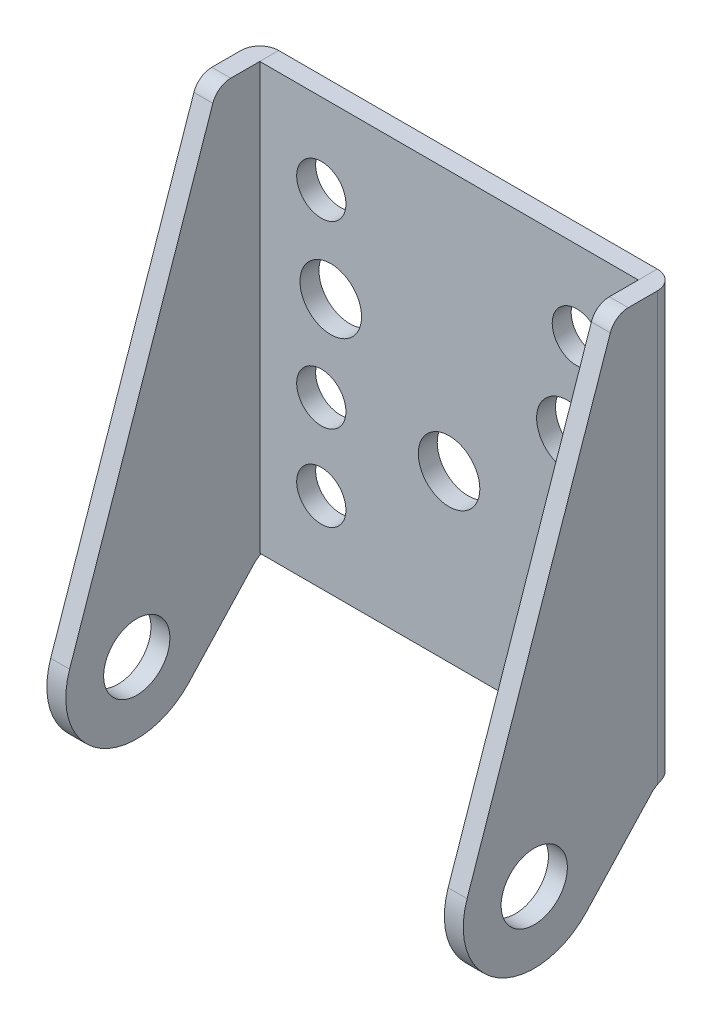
ISO-10303-21;
HEADER;
FILE_DESCRIPTION(('STEP AP214'),'2;1');
FILE_NAME('part.step','',(''),(''),'','','');
FILE_SCHEMA(('AUTOMOTIVE_DESIGN { 1 0 10303 214 1 1 1 1 }'));
ENDSEC;
DATA;
#1=APPLICATION_CONTEXT('core data for automotive mechanical design processes');
#2=APPLICATION_PROTOCOL_DEFINITION('international standard','automotive_design',2000,#1);
#3=PRODUCT_CONTEXT('',#1,'mechanical');
#4=PRODUCT('Part','Part','',(#3));
#5=PRODUCT_RELATED_PRODUCT_CATEGORY('part','',(#4));
#6=PRODUCT_DEFINITION_FORMATION('','',#4);
#7=PRODUCT_DEFINITION_CONTEXT('part definition',#1,'design');
#8=PRODUCT_DEFINITION('design','',#6,#7);
#9=PRODUCT_DEFINITION_SHAPE('','',#8);
#10=(LENGTH_UNIT() NAMED_UNIT(*) SI_UNIT(.MILLI.,.METRE.));
#11=(NAMED_UNIT(*) PLANE_ANGLE_UNIT() SI_UNIT($,.RADIAN.));
#12=(NAMED_UNIT(*) SI_UNIT($,.STERADIAN.) SOLID_ANGLE_UNIT());
#13=UNCERTAINTY_MEASURE_WITH_UNIT(LENGTH_MEASURE(1.E-05),#10,'distance_accuracy_value','');
#14=(GEOMETRIC_REPRESENTATION_CONTEXT(3) GLOBAL_UNCERTAINTY_ASSIGNED_CONTEXT((#13)) GLOBAL_UNIT_ASSIGNED_CONTEXT((#10,
#11,#12)) REPRESENTATION_CONTEXT('',''));
#15=CARTESIAN_POINT('',(0.,0.,0.));
#16=DIRECTION('',(0.,0.,1.));
#17=DIRECTION('',(1.,0.,0.));
#18=AXIS2_PLACEMENT_3D('',#15,#16,#17);
#19=CARTESIAN_POINT('',(-22.,-25.5,15.));
#20=DIRECTION('',(-1.,0.,0.));
#21=DIRECTION('',(0.,1.,0.));
#22=AXIS2_PLACEMENT_3D('',#19,#20,#21);
#23=PLANE('',#22);
#24=DIRECTION('',(0.,0.,1.));
#25=VECTOR('',#24,1.);
#26=CARTESIAN_POINT('',(-22.,22.5,0.));
#27=LINE('',#26,#25);
#28=CARTESIAN_POINT('',(-22.,22.5,2.));
#29=VERTEX_POINT('',#28);
#30=CARTESIAN_POINT('',(-22.,22.5,5.07058096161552));
#31=VERTEX_POINT('',#30);
#32=EDGE_CURVE('E129',#29,#31,#27,.T.);
#33=ORIENTED_EDGE('',*,*,#32,.F.);
#34=DIRECTION('',(0.,1.,0.));
#35=VECTOR('',#34,1.);
#36=CARTESIAN_POINT('',(-22.,-22.5,2.));
#37=LINE('',#36,#35);
#38=CARTESIAN_POINT('',(-22.,-22.7009607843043,2.));
#39=VERTEX_POINT('',#38);
#40=EDGE_CURVE('E66',#29,#39,#37,.F.);
#41=ORIENTED_EDGE('',*,*,#40,.T.);
#42=CARTESIAN_POINT('',(-22.,-24.5,1.12623922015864));
#43=DIRECTION('',(1.,0.,0.));
#44=DIRECTION('',(0.,1.,0.));
#45=AXIS2_PLACEMENT_3D('',#42,#43,#44);
#46=CIRCLE('',#45,2.);
#47=CARTESIAN_POINT('',(-22.,-23.1410955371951,2.59367871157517));
#48=VERTEX_POINT('',#47);
#49=EDGE_CURVE('E170',#48,#39,#46,.F.);
#50=ORIENTED_EDGE('',*,*,#49,.F.);
#51=DIRECTION('',(0.,0.733719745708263,-0.679452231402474));
#52=VECTOR('',#51,1.);
#53=CARTESIAN_POINT('',(-22.,-22.5,2.));
#54=LINE('',#53,#52);
#55=CARTESIAN_POINT('',(-22.,-30.5958917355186,9.49710190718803));
#56=VERTEX_POINT('',#55);
#57=EDGE_CURVE('E133',#56,#48,#54,.T.);
#58=ORIENTED_EDGE('',*,*,#57,.F.);
#59=CARTESIAN_POINT('',(-22.,-25.5,15.));
#60=DIRECTION('',(1.,0.,0.));
#61=DIRECTION('',(0.,1.,0.));
#62=AXIS2_PLACEMENT_3D('',#59,#60,#61);
#63=CIRCLE('',#62,7.5);
#64=CARTESIAN_POINT('',(-22.,-23.0715490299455,22.0959584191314));
#65=VERTEX_POINT('',#64);
#66=EDGE_CURVE('E113',#65,#56,#63,.T.);
#67=ORIENTED_EDGE('',*,*,#66,.F.);
#68=DIRECTION('',(0.,-0.946127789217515,0.323793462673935));
#69=VECTOR('',#68,1.);
#70=CARTESIAN_POINT('',(-22.,22.5,6.5));
#71=LINE('',#70,#69);
#72=CARTESIAN_POINT('',(-22.,21.1475869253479,6.96283654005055));
#73=VERTEX_POINT('',#72);
#74=EDGE_CURVE('E124',#73,#65,#71,.T.);
#75=ORIENTED_EDGE('',*,*,#74,.F.);
#76=CARTESIAN_POINT('',(-22.,20.5,5.07058096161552));
#77=DIRECTION('',(1.,0.,0.));
#78=DIRECTION('',(0.,1.,0.));
#79=AXIS2_PLACEMENT_3D('',#76,#77,#78);
#80=CIRCLE('',#79,2.);
#81=EDGE_CURVE('E165',#31,#73,#80,.T.);
#82=ORIENTED_EDGE('',*,*,#81,.F.);
#83=EDGE_LOOP('',(#33,#41,#50,#58,#67,#75,#82));
#84=FACE_BOUND('',#83,.T.);
#85=CARTESIAN_POINT('',(-22.,-25.5,15.));
#86=DIRECTION('',(1.,0.,0.));
#87=DIRECTION('',(0.,1.,0.));
#88=AXIS2_PLACEMENT_3D('',#85,#86,#87);
#89=CIRCLE('',#88,3.5);
#90=CARTESIAN_POINT('',(-22.,-22.,15.));
#91=VERTEX_POINT('',#90);
#92=EDGE_CURVE('E142',#91,#91,#89,.T.);
#93=ORIENTED_EDGE('',*,*,#92,.T.);
#94=EDGE_LOOP('',(#93));
#95=FACE_BOUND('',#94,.T.);
#96=ADVANCED_FACE('F43',(#84,#95),#23,.T.);
#97=CARTESIAN_POINT('',(-20.,-25.5,15.));
#98=DIRECTION('',(-1.,0.,0.));
#99=DIRECTION('',(0.,1.,0.));
#100=AXIS2_PLACEMENT_3D('',#97,#98,#99);
#101=PLANE('',#100);
#102=DIRECTION('',(0.,-0.946127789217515,0.323793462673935));
#103=VECTOR('',#102,1.);
#104=CARTESIAN_POINT('',(-20.,22.5,6.5));
#105=LINE('',#104,#103);
#106=CARTESIAN_POINT('',(-20.,21.1475869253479,6.96283654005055));
#107=VERTEX_POINT('',#106);
#108=CARTESIAN_POINT('',(-20.,-23.0715490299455,22.0959584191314));
#109=VERTEX_POINT('',#108);
#110=EDGE_CURVE('E145',#107,#109,#105,.T.);
#111=ORIENTED_EDGE('',*,*,#110,.T.);
#112=CARTESIAN_POINT('',(-20.,-25.5,15.));
#113=DIRECTION('',(1.,0.,0.));
#114=DIRECTION('',(0.,1.,0.));
#115=AXIS2_PLACEMENT_3D('',#112,#113,#114);
#116=CIRCLE('',#115,7.5);
#117=CARTESIAN_POINT('',(-20.,-30.5958917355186,9.49710190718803));
#118=VERTEX_POINT('',#117);
#119=EDGE_CURVE('E116',#109,#118,#116,.T.);
#120=ORIENTED_EDGE('',*,*,#119,.T.);
#121=DIRECTION('',(0.,0.733719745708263,-0.679452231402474));
#122=VECTOR('',#121,1.);
#123=CARTESIAN_POINT('',(-20.,-22.5,2.));
#124=LINE('',#123,#122);
#125=CARTESIAN_POINT('',(-20.,-23.1410955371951,2.59367871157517));
#126=VERTEX_POINT('',#125);
#127=EDGE_CURVE('E148',#118,#126,#124,.T.);
#128=ORIENTED_EDGE('',*,*,#127,.T.);
#129=CARTESIAN_POINT('',(-20.,-24.5,1.12623922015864));
#130=DIRECTION('',(1.,0.,0.));
#131=DIRECTION('',(0.,1.,0.));
#132=AXIS2_PLACEMENT_3D('',#129,#130,#131);
#133=CIRCLE('',#132,2.);
#134=CARTESIAN_POINT('',(-20.,-22.5,1.12623922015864));
#135=VERTEX_POINT('',#134);
#136=EDGE_CURVE('E167',#135,#126,#133,.T.);
#137=ORIENTED_EDGE('',*,*,#136,.F.);
#138=DIRECTION('',(0.,0.,-1.));
#139=VECTOR('',#138,1.);
#140=CARTESIAN_POINT('',(-20.,-22.5,2.));
#141=LINE('',#140,#139);
#142=CARTESIAN_POINT('',(-20.,-22.5,0.));
#143=VERTEX_POINT('',#142);
#144=EDGE_CURVE('E151',#135,#143,#141,.T.);
#145=ORIENTED_EDGE('',*,*,#144,.T.);
#146=DIRECTION('',(0.,1.,0.));
#147=VECTOR('',#146,1.);
#148=CARTESIAN_POINT('',(-20.,-22.5,0.));
#149=LINE('',#148,#147);
#150=CARTESIAN_POINT('',(-20.,22.5,0.));
#151=VERTEX_POINT('',#150);
#152=EDGE_CURVE('E138',#143,#151,#149,.T.);
#153=ORIENTED_EDGE('',*,*,#152,.T.);
#154=DIRECTION('',(0.,0.,1.));
#155=VECTOR('',#154,1.);
#156=CARTESIAN_POINT('',(-20.,22.5,0.));
#157=LINE('',#156,#155);
#158=CARTESIAN_POINT('',(-20.,22.5,5.07058096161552));
#159=VERTEX_POINT('',#158);
#160=EDGE_CURVE('E141',#151,#159,#157,.T.);
#161=ORIENTED_EDGE('',*,*,#160,.T.);
#162=CARTESIAN_POINT('',(-20.,20.5,5.07058096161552));
#163=DIRECTION('',(1.,0.,0.));
#164=DIRECTION('',(0.,1.,0.));
#165=AXIS2_PLACEMENT_3D('',#162,#163,#164);
#166=CIRCLE('',#165,2.);
#167=EDGE_CURVE('E159',#107,#159,#166,.F.);
#168=ORIENTED_EDGE('',*,*,#167,.F.);
#169=EDGE_LOOP('',(#111,#120,#128,#137,#145,#153,#161,#168));
#170=FACE_BOUND('',#169,.T.);
#171=CARTESIAN_POINT('',(-20.,-25.5,15.));
#172=DIRECTION('',(1.,0.,0.));
#173=DIRECTION('',(0.,1.,0.));
#174=AXIS2_PLACEMENT_3D('',#171,#172,#173);
#175=CIRCLE('',#174,3.5);
#176=CARTESIAN_POINT('',(-20.,-22.,15.));
#177=VERTEX_POINT('',#176);
#178=EDGE_CURVE('E227',#177,#177,#175,.T.);
#179=ORIENTED_EDGE('',*,*,#178,.F.);
#180=EDGE_LOOP('',(#179));
#181=FACE_BOUND('',#180,.T.);
#182=ADVANCED_FACE('F193',(#170,#181),#101,.F.);
#183=CARTESIAN_POINT('',(-22.,22.5,0.));
#184=DIRECTION('',(0.,-1.,0.));
#185=DIRECTION('',(0.,0.,-1.));
#186=AXIS2_PLACEMENT_3D('',#183,#184,#185);
#187=PLANE('',#186);
#188=ORIENTED_EDGE('',*,*,#160,.F.);
#189=CARTESIAN_POINT('',(-20.,22.5,2.));
#190=DIRECTION('',(0.,-1.,0.));
#191=DIRECTION('',(0.,0.,-1.));
#192=AXIS2_PLACEMENT_3D('',#189,#190,#191);
#193=CIRCLE('',#192,2.);
#194=EDGE_CURVE('E172',#151,#29,#193,.F.);
#195=ORIENTED_EDGE('',*,*,#194,.T.);
#196=ORIENTED_EDGE('',*,*,#32,.T.);
#197=DIRECTION('',(1.,0.,0.));
#198=VECTOR('',#197,1.);
#199=CARTESIAN_POINT('',(-22.,22.5,5.07058096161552));
#200=LINE('',#199,#198);
#201=EDGE_CURVE('E162',#159,#31,#200,.F.);
#202=ORIENTED_EDGE('',*,*,#201,.F.);
#203=EDGE_LOOP('',(#188,#195,#196,#202));
#204=FACE_BOUND('',#203,.T.);
#205=ADVANCED_FACE('F184',(#204),#187,.F.);
#206=CARTESIAN_POINT('',(-22.,22.5,6.5));
#207=DIRECTION('',(0.,-0.323793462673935,-0.946127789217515));
#208=DIRECTION('',(0.,0.946127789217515,-0.323793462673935));
#209=AXIS2_PLACEMENT_3D('',#206,#207,#208);
#210=PLANE('',#209);
#211=ORIENTED_EDGE('',*,*,#74,.T.);
#212=DIRECTION('',(1.,0.,0.));
#213=VECTOR('',#212,1.);
#214=CARTESIAN_POINT('',(-22.,-23.0715490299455,22.0959584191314));
#215=LINE('',#214,#213);
#216=EDGE_CURVE('E109',#65,#109,#215,.T.);
#217=ORIENTED_EDGE('',*,*,#216,.T.);
#218=ORIENTED_EDGE('',*,*,#110,.F.);
#219=DIRECTION('',(1.,0.,0.));
#220=VECTOR('',#219,1.);
#221=CARTESIAN_POINT('',(-22.,21.1475869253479,6.96283654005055));
#222=LINE('',#221,#220);
#223=EDGE_CURVE('E126',#73,#107,#222,.T.);
#224=ORIENTED_EDGE('',*,*,#223,.F.);
#225=EDGE_LOOP('',(#211,#217,#218,#224));
#226=FACE_BOUND('',#225,.T.);
#227=ADVANCED_FACE('F125',(#226),#210,.F.);
#228=CARTESIAN_POINT('',(-22.,-25.5,15.));
#229=DIRECTION('',(1.,0.,0.));
#230=DIRECTION('',(0.,-1.,0.));
#231=AXIS2_PLACEMENT_3D('',#228,#229,#230);
#232=CYLINDRICAL_SURFACE('',#231,7.5);
#233=ORIENTED_EDGE('',*,*,#119,.F.);
#234=ORIENTED_EDGE('',*,*,#216,.F.);
#235=ORIENTED_EDGE('',*,*,#66,.T.);
#236=DIRECTION('',(1.,0.,0.));
#237=VECTOR('',#236,1.);
#238=CARTESIAN_POINT('',(-22.,-30.5958917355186,9.49710190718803));
#239=LINE('',#238,#237);
#240=EDGE_CURVE('E121',#56,#118,#239,.T.);
#241=ORIENTED_EDGE('',*,*,#240,.T.);
#242=EDGE_LOOP('',(#233,#234,#235,#241));
#243=FACE_BOUND('',#242,.T.);
#244=ADVANCED_FACE('F111',(#243),#232,.T.);
#245=CARTESIAN_POINT('',(-22.,-22.5,2.));
#246=DIRECTION('',(0.,0.679452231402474,0.733719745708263));
#247=DIRECTION('',(0.,-0.733719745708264,0.679452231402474));
#248=AXIS2_PLACEMENT_3D('',#245,#246,#247);
#249=PLANE('',#248);
#250=ORIENTED_EDGE('',*,*,#127,.F.);
#251=ORIENTED_EDGE('',*,*,#240,.F.);
#252=ORIENTED_EDGE('',*,*,#57,.T.);
#253=DIRECTION('',(1.,0.,0.));
#254=VECTOR('',#253,1.);
#255=CARTESIAN_POINT('',(-22.,-23.1410955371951,2.59367871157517));
#256=LINE('',#255,#254);
#257=EDGE_CURVE('E156',#126,#48,#256,.F.);
#258=ORIENTED_EDGE('',*,*,#257,.F.);
#259=EDGE_LOOP('',(#250,#251,#252,#258));
#260=FACE_BOUND('',#259,.T.);
#261=ADVANCED_FACE('F205',(#260),#249,.F.);
#262=CARTESIAN_POINT('',(-22.,-22.5,2.));
#263=DIRECTION('',(0.,1.,0.));
#264=DIRECTION('',(1.,0.,0.));
#265=AXIS2_PLACEMENT_3D('',#262,#263,#264);
#266=PLANE('',#265);
#267=DIRECTION('',(1.,0.,0.));
#268=VECTOR('',#267,1.);
#269=CARTESIAN_POINT('',(-20.,-22.5,1.12623922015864));
#270=LINE('',#269,#268);
#271=CARTESIAN_POINT('',(-21.7990392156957,-22.5,1.12623922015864));
#272=VERTEX_POINT('',#271);
#273=EDGE_CURVE('E120',#272,#135,#270,.T.);
#274=ORIENTED_EDGE('',*,*,#273,.F.);
#275=CARTESIAN_POINT('',(-20.,-22.5,2.));
#276=DIRECTION('',(0.,1.,0.));
#277=DIRECTION('',(-1.,0.,0.));
#278=AXIS2_PLACEMENT_3D('',#275,#276,#277);
#279=CIRCLE('',#278,2.);
#280=EDGE_CURVE('E12',#272,#143,#279,.F.);
#281=ORIENTED_EDGE('',*,*,#280,.T.);
#282=ORIENTED_EDGE('',*,*,#144,.F.);
#283=EDGE_LOOP('',(#274,#281,#282));
#284=FACE_BOUND('',#283,.T.);
#285=ADVANCED_FACE('F202',(#284),#266,.F.);
#286=CARTESIAN_POINT('',(-22.,-25.5,15.));
#287=DIRECTION('',(1.,0.,0.));
#288=DIRECTION('',(0.,-1.,0.));
#289=AXIS2_PLACEMENT_3D('',#286,#287,#288);
#290=CYLINDRICAL_SURFACE('',#289,3.5);
#291=ORIENTED_EDGE('',*,*,#92,.F.);
#292=EDGE_LOOP('',(#291));
#293=FACE_BOUND('',#292,.T.);
#294=ORIENTED_EDGE('',*,*,#178,.T.);
#295=EDGE_LOOP('',(#294));
#296=FACE_BOUND('',#295,.T.);
#297=ADVANCED_FACE('F183',(#293,#296),#290,.F.);
#298=CARTESIAN_POINT('',(-22.,-24.5,1.12623922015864));
#299=DIRECTION('',(-1.,0.,0.));
#300=DIRECTION('',(0.,1.,0.));
#301=AXIS2_PLACEMENT_3D('',#298,#299,#300);
#302=CYLINDRICAL_SURFACE('',#301,2.);
#303=ORIENTED_EDGE('',*,*,#49,.T.);
#304=CARTESIAN_POINT('',(-22.,-22.7009607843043,2.));
#305=CARTESIAN_POINT('',(-22.0000069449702,-22.682475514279,1.96195832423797));
#306=CARTESIAN_POINT('',(-21.9989146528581,-22.665208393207,1.92331665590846));
#307=CARTESIAN_POINT('',(-21.9943773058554,-22.6331897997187,1.84512486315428));
#308=CARTESIAN_POINT('',(-21.9909314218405,-22.6184392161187,1.80557442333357));
#309=CARTESIAN_POINT('',(-21.9816566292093,-22.5919017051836,1.72693731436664));
#310=CARTESIAN_POINT('',(-21.9758931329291,-22.5800467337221,1.68786602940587));
#311=CARTESIAN_POINT('',(-21.961912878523,-22.5588402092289,1.60950760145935));
#312=CARTESIAN_POINT('',(-21.953696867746,-22.5494878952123,1.57022052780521));
#313=CARTESIAN_POINT('',(-21.9278031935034,-22.5273224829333,1.46291954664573));
#314=CARTESIAN_POINT('',(-21.9076044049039,-22.5169971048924,1.39495619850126));
#315=CARTESIAN_POINT('',(-21.8715063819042,-22.5067268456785,1.29374419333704));
#316=CARTESIAN_POINT('',(-21.8583170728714,-22.5041752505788,1.25973549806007));
#317=CARTESIAN_POINT('',(-21.8300677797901,-22.5008118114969,1.19242175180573));
#318=CARTESIAN_POINT('',(-21.8150081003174,-22.4999996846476,1.15911658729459));
#319=CARTESIAN_POINT('',(-21.7990392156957,-22.5,1.12623922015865));
#320=B_SPLINE_CURVE_WITH_KNOTS('',3,(#304,#305,#306,#307,#308,#309,#310,#311,#312,#313,#314,
#315,#316,#317,#318,#319),.UNSPECIFIED.,.F.,.F.,(4,2,2,2,2,2,2,4),(0.,0.126860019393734,
0.25376475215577,0.377314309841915,0.500826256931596,0.714867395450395,0.824485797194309,
0.934086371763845),.UNSPECIFIED.);
#321=EDGE_CURVE('E52',#39,#272,#320,.T.);
#322=ORIENTED_EDGE('',*,*,#321,.T.);
#323=ORIENTED_EDGE('',*,*,#273,.T.);
#324=ORIENTED_EDGE('',*,*,#136,.T.);
#325=ORIENTED_EDGE('',*,*,#257,.T.);
#326=EDGE_LOOP('',(#303,#322,#323,#324,#325));
#327=FACE_BOUND('',#326,.T.);
#328=ADVANCED_FACE('F178',(#327),#302,.F.);
#329=CARTESIAN_POINT('',(-22.,20.5,5.07058096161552));
#330=DIRECTION('',(1.,0.,0.));
#331=DIRECTION('',(0.,-1.,0.));
#332=AXIS2_PLACEMENT_3D('',#329,#330,#331);
#333=CYLINDRICAL_SURFACE('',#332,2.);
#334=ORIENTED_EDGE('',*,*,#81,.T.);
#335=ORIENTED_EDGE('',*,*,#223,.T.);
#336=ORIENTED_EDGE('',*,*,#167,.T.);
#337=ORIENTED_EDGE('',*,*,#201,.T.);
#338=EDGE_LOOP('',(#334,#335,#336,#337));
#339=FACE_BOUND('',#338,.T.);
#340=ADVANCED_FACE('F182',(#339),#333,.T.);
#341=CARTESIAN_POINT('',(-20.,-22.5,2.));
#342=DIRECTION('',(0.,-1.,0.));
#343=DIRECTION('',(1.,0.,0.));
#344=AXIS2_PLACEMENT_3D('',#341,#342,#343);
#345=CYLINDRICAL_SURFACE('',#344,2.);
#346=ORIENTED_EDGE('',*,*,#321,.F.);
#347=ORIENTED_EDGE('',*,*,#40,.F.);
#348=ORIENTED_EDGE('',*,*,#194,.F.);
#349=ORIENTED_EDGE('',*,*,#152,.F.);
#350=ORIENTED_EDGE('',*,*,#280,.F.);
#351=EDGE_LOOP('',(#346,#347,#348,#349,#350));
#352=FACE_BOUND('',#351,.T.);
#353=ADVANCED_FACE('F45',(#352),#345,.T.);
#354=CLOSED_SHELL('',(#96,#182,#205,#227,#244,#261,#285,#297,#328,#340,#353));
#355=MANIFOLD_SOLID_BREP('B2',#354);
#356=CARTESIAN_POINT('',(22.,-25.5,15.));
#357=DIRECTION('',(1.,0.,0.));
#358=DIRECTION('',(0.,1.,0.));
#359=AXIS2_PLACEMENT_3D('',#356,#357,#358);
#360=PLANE('',#359);
#361=CARTESIAN_POINT('',(22.,-24.5,1.12623922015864));
#362=DIRECTION('',(1.,0.,0.));
#363=DIRECTION('',(0.,1.,0.));
#364=AXIS2_PLACEMENT_3D('',#361,#362,#363);
#365=CIRCLE('',#364,2.);
#366=CARTESIAN_POINT('',(22.,-23.1410955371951,2.59367871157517));
#367=VERTEX_POINT('',#366);
#368=CARTESIAN_POINT('',(22.,-22.7009607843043,2.));
#369=VERTEX_POINT('',#368);
#370=EDGE_CURVE('E433',#367,#369,#365,.F.);
#371=ORIENTED_EDGE('',*,*,#370,.T.);
#372=DIRECTION('',(0.,1.,0.));
#373=VECTOR('',#372,1.);
#374=CARTESIAN_POINT('',(22.,22.5,2.));
#375=LINE('',#374,#373);
#376=CARTESIAN_POINT('',(22.,22.5,2.));
#377=VERTEX_POINT('',#376);
#378=EDGE_CURVE('E435',#369,#377,#375,.T.);
#379=ORIENTED_EDGE('',*,*,#378,.T.);
#380=DIRECTION('',(0.,0.,1.));
#381=VECTOR('',#380,1.);
#382=CARTESIAN_POINT('',(22.,22.5,0.));
#383=LINE('',#382,#381);
#384=CARTESIAN_POINT('',(22.,22.5,5.07058096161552));
#385=VERTEX_POINT('',#384);
#386=EDGE_CURVE('E384',#377,#385,#383,.T.);
#387=ORIENTED_EDGE('',*,*,#386,.T.);
#388=CARTESIAN_POINT('',(22.,20.5,5.07058096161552));
#389=DIRECTION('',(1.,0.,0.));
#390=DIRECTION('',(0.,1.,0.));
#391=AXIS2_PLACEMENT_3D('',#388,#389,#390);
#392=CIRCLE('',#391,2.);
#393=CARTESIAN_POINT('',(22.,21.1475869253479,6.96283654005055));
#394=VERTEX_POINT('',#393);
#395=EDGE_CURVE('E380',#385,#394,#392,.T.);
#396=ORIENTED_EDGE('',*,*,#395,.T.);
#397=DIRECTION('',(0.,-0.946127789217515,0.323793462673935));
#398=VECTOR('',#397,1.);
#399=CARTESIAN_POINT('',(22.,22.5,6.5));
#400=LINE('',#399,#398);
#401=CARTESIAN_POINT('',(22.,-23.0715490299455,22.0959584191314));
#402=VERTEX_POINT('',#401);
#403=EDGE_CURVE('E372',#394,#402,#400,.T.);
#404=ORIENTED_EDGE('',*,*,#403,.T.);
#405=CARTESIAN_POINT('',(22.,-25.5,15.));
#406=DIRECTION('',(1.,0.,0.));
#407=DIRECTION('',(0.,1.,0.));
#408=AXIS2_PLACEMENT_3D('',#405,#406,#407);
#409=CIRCLE('',#408,7.5);
#410=CARTESIAN_POINT('',(22.,-30.5958917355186,9.49710190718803));
#411=VERTEX_POINT('',#410);
#412=EDGE_CURVE('E377',#402,#411,#409,.T.);
#413=ORIENTED_EDGE('',*,*,#412,.T.);
#414=DIRECTION('',(0.,0.733719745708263,-0.679452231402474));
#415=VECTOR('',#414,1.);
#416=CARTESIAN_POINT('',(22.,-22.5,2.));
#417=LINE('',#416,#415);
#418=EDGE_CURVE('E399',#411,#367,#417,.T.);
#419=ORIENTED_EDGE('',*,*,#418,.T.);
#420=EDGE_LOOP('',(#371,#379,#387,#396,#404,#413,#419));
#421=FACE_BOUND('',#420,.T.);
#422=CARTESIAN_POINT('',(22.,-25.5,15.));
#423=DIRECTION('',(1.,0.,0.));
#424=DIRECTION('',(0.,1.,0.));
#425=AXIS2_PLACEMENT_3D('',#422,#423,#424);
#426=CIRCLE('',#425,3.5);
#427=CARTESIAN_POINT('',(22.,-22.,15.));
#428=VERTEX_POINT('',#427);
#429=EDGE_CURVE('E408',#428,#428,#426,.T.);
#430=ORIENTED_EDGE('',*,*,#429,.F.);
#431=EDGE_LOOP('',(#430));
#432=FACE_BOUND('',#431,.T.);
#433=ADVANCED_FACE('F305',(#421,#432),#360,.T.);
#434=CARTESIAN_POINT('',(20.,-25.5,15.));
#435=DIRECTION('',(1.,0.,0.));
#436=DIRECTION('',(0.,1.,0.));
#437=AXIS2_PLACEMENT_3D('',#434,#435,#436);
#438=PLANE('',#437);
#439=DIRECTION('',(0.,-0.946127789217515,0.323793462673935));
#440=VECTOR('',#439,1.);
#441=CARTESIAN_POINT('',(20.,22.5,6.5));
#442=LINE('',#441,#440);
#443=CARTESIAN_POINT('',(20.,21.1475869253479,6.96283654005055));
#444=VERTEX_POINT('',#443);
#445=CARTESIAN_POINT('',(20.,-23.0715490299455,22.0959584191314));
#446=VERTEX_POINT('',#445);
#447=EDGE_CURVE('E390',#444,#446,#442,.T.);
#448=ORIENTED_EDGE('',*,*,#447,.F.);
#449=CARTESIAN_POINT('',(20.,20.5,5.07058096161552));
#450=DIRECTION('',(1.,0.,0.));
#451=DIRECTION('',(0.,1.,0.));
#452=AXIS2_PLACEMENT_3D('',#449,#450,#451);
#453=CIRCLE('',#452,2.);
#454=CARTESIAN_POINT('',(20.,22.5,5.07058096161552));
#455=VERTEX_POINT('',#454);
#456=EDGE_CURVE('E425',#444,#455,#453,.F.);
#457=ORIENTED_EDGE('',*,*,#456,.T.);
#458=DIRECTION('',(0.,0.,1.));
#459=VECTOR('',#458,1.);
#460=CARTESIAN_POINT('',(20.,22.5,0.));
#461=LINE('',#460,#459);
#462=CARTESIAN_POINT('',(20.,22.5,0.));
#463=VERTEX_POINT('',#462);
#464=EDGE_CURVE('E407',#463,#455,#461,.T.);
#465=ORIENTED_EDGE('',*,*,#464,.F.);
#466=DIRECTION('',(0.,1.,0.));
#467=VECTOR('',#466,1.);
#468=CARTESIAN_POINT('',(20.,-22.5,0.));
#469=LINE('',#468,#467);
#470=CARTESIAN_POINT('',(20.,-22.5,0.));
#471=VERTEX_POINT('',#470);
#472=EDGE_CURVE('E404',#471,#463,#469,.T.);
#473=ORIENTED_EDGE('',*,*,#472,.F.);
#474=DIRECTION('',(0.,0.,-1.));
#475=VECTOR('',#474,1.);
#476=CARTESIAN_POINT('',(20.,-22.5,2.));
#477=LINE('',#476,#475);
#478=CARTESIAN_POINT('',(20.,-22.5,1.12623922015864));
#479=VERTEX_POINT('',#478);
#480=EDGE_CURVE('E417',#479,#471,#477,.T.);
#481=ORIENTED_EDGE('',*,*,#480,.F.);
#482=CARTESIAN_POINT('',(20.,-24.5,1.12623922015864));
#483=DIRECTION('',(1.,0.,0.));
#484=DIRECTION('',(0.,1.,0.));
#485=AXIS2_PLACEMENT_3D('',#482,#483,#484);
#486=CIRCLE('',#485,2.);
#487=CARTESIAN_POINT('',(20.,-23.1410955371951,2.59367871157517));
#488=VERTEX_POINT('',#487);
#489=EDGE_CURVE('E431',#479,#488,#486,.T.);
#490=ORIENTED_EDGE('',*,*,#489,.T.);
#491=DIRECTION('',(0.,0.733719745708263,-0.679452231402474));
#492=VECTOR('',#491,1.);
#493=CARTESIAN_POINT('',(20.,-22.5,2.));
#494=LINE('',#493,#492);
#495=CARTESIAN_POINT('',(20.,-30.5958917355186,9.49710190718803));
#496=VERTEX_POINT('',#495);
#497=EDGE_CURVE('E414',#496,#488,#494,.T.);
#498=ORIENTED_EDGE('',*,*,#497,.F.);
#499=CARTESIAN_POINT('',(20.,-25.5,15.));
#500=DIRECTION('',(1.,0.,0.));
#501=DIRECTION('',(0.,1.,0.));
#502=AXIS2_PLACEMENT_3D('',#499,#500,#501);
#503=CIRCLE('',#502,7.5);
#504=EDGE_CURVE('E412',#446,#496,#503,.T.);
#505=ORIENTED_EDGE('',*,*,#504,.F.);
#506=EDGE_LOOP('',(#448,#457,#465,#473,#481,#490,#498,#505));
#507=FACE_BOUND('',#506,.T.);
#508=CARTESIAN_POINT('',(20.,-25.5,15.));
#509=DIRECTION('',(1.,0.,0.));
#510=DIRECTION('',(0.,1.,0.));
#511=AXIS2_PLACEMENT_3D('',#508,#509,#510);
#512=CIRCLE('',#511,3.5);
#513=CARTESIAN_POINT('',(20.,-22.,15.));
#514=VERTEX_POINT('',#513);
#515=EDGE_CURVE('E553',#514,#514,#512,.T.);
#516=ORIENTED_EDGE('',*,*,#515,.T.);
#517=EDGE_LOOP('',(#516));
#518=FACE_BOUND('',#517,.T.);
#519=ADVANCED_FACE('F448',(#507,#518),#438,.F.);
#520=CARTESIAN_POINT('',(22.,22.5,0.));
#521=DIRECTION('',(0.,-1.,0.));
#522=DIRECTION('',(0.,0.,-1.));
#523=AXIS2_PLACEMENT_3D('',#520,#521,#522);
#524=PLANE('',#523);
#525=ORIENTED_EDGE('',*,*,#386,.F.);
#526=CARTESIAN_POINT('',(20.,22.5,2.));
#527=DIRECTION('',(0.,-1.,0.));
#528=DIRECTION('',(0.,0.,-1.));
#529=AXIS2_PLACEMENT_3D('',#526,#527,#528);
#530=CIRCLE('',#529,2.);
#531=EDGE_CURVE('E438',#377,#463,#530,.F.);
#532=ORIENTED_EDGE('',*,*,#531,.T.);
#533=ORIENTED_EDGE('',*,*,#464,.T.);
#534=DIRECTION('',(-1.,0.,0.));
#535=VECTOR('',#534,1.);
#536=CARTESIAN_POINT('',(22.,22.5,5.07058096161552));
#537=LINE('',#536,#535);
#538=EDGE_CURVE('E427',#455,#385,#537,.F.);
#539=ORIENTED_EDGE('',*,*,#538,.T.);
#540=EDGE_LOOP('',(#525,#532,#533,#539));
#541=FACE_BOUND('',#540,.T.);
#542=ADVANCED_FACE('F442',(#541),#524,.F.);
#543=CARTESIAN_POINT('',(22.,22.5,6.5));
#544=DIRECTION('',(0.,-0.323793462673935,-0.946127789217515));
#545=DIRECTION('',(0.,0.946127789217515,-0.323793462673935));
#546=AXIS2_PLACEMENT_3D('',#543,#544,#545);
#547=PLANE('',#546);
#548=ORIENTED_EDGE('',*,*,#403,.F.);
#549=DIRECTION('',(-1.,0.,0.));
#550=VECTOR('',#549,1.);
#551=CARTESIAN_POINT('',(22.,21.1475869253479,6.96283654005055));
#552=LINE('',#551,#550);
#553=EDGE_CURVE('E423',#394,#444,#552,.T.);
#554=ORIENTED_EDGE('',*,*,#553,.T.);
#555=ORIENTED_EDGE('',*,*,#447,.T.);
#556=DIRECTION('',(-1.,0.,0.));
#557=VECTOR('',#556,1.);
#558=CARTESIAN_POINT('',(22.,-23.0715490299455,22.0959584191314));
#559=LINE('',#558,#557);
#560=EDGE_CURVE('E387',#402,#446,#559,.T.);
#561=ORIENTED_EDGE('',*,*,#560,.F.);
#562=EDGE_LOOP('',(#548,#554,#555,#561));
#563=FACE_BOUND('',#562,.T.);
#564=ADVANCED_FACE('F388',(#563),#547,.F.);
#565=CARTESIAN_POINT('',(22.,-25.5,15.));
#566=DIRECTION('',(-1.,0.,0.));
#567=DIRECTION('',(0.,-1.,0.));
#568=AXIS2_PLACEMENT_3D('',#565,#566,#567);
#569=CYLINDRICAL_SURFACE('',#568,7.5);
#570=ORIENTED_EDGE('',*,*,#504,.T.);
#571=DIRECTION('',(-1.,0.,0.));
#572=VECTOR('',#571,1.);
#573=CARTESIAN_POINT('',(22.,-30.5958917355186,9.49710190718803));
#574=LINE('',#573,#572);
#575=EDGE_CURVE('E394',#411,#496,#574,.T.);
#576=ORIENTED_EDGE('',*,*,#575,.F.);
#577=ORIENTED_EDGE('',*,*,#412,.F.);
#578=ORIENTED_EDGE('',*,*,#560,.T.);
#579=EDGE_LOOP('',(#570,#576,#577,#578));
#580=FACE_BOUND('',#579,.T.);
#581=ADVANCED_FACE('F396',(#580),#569,.T.);
#582=CARTESIAN_POINT('',(22.,-22.5,2.));
#583=DIRECTION('',(0.,0.679452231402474,0.733719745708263));
#584=DIRECTION('',(0.,-0.733719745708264,0.679452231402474));
#585=AXIS2_PLACEMENT_3D('',#582,#583,#584);
#586=PLANE('',#585);
#587=ORIENTED_EDGE('',*,*,#497,.T.);
#588=DIRECTION('',(-1.,0.,0.));
#589=VECTOR('',#588,1.);
#590=CARTESIAN_POINT('',(22.,-23.1410955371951,2.59367871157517));
#591=LINE('',#590,#589);
#592=EDGE_CURVE('E421',#488,#367,#591,.F.);
#593=ORIENTED_EDGE('',*,*,#592,.T.);
#594=ORIENTED_EDGE('',*,*,#418,.F.);
#595=ORIENTED_EDGE('',*,*,#575,.T.);
#596=EDGE_LOOP('',(#587,#593,#594,#595));
#597=FACE_BOUND('',#596,.T.);
#598=ADVANCED_FACE('F455',(#597),#586,.F.);
#599=CARTESIAN_POINT('',(22.,-22.5,2.));
#600=DIRECTION('',(0.,1.,0.));
#601=DIRECTION('',(-1.,0.,0.));
#602=AXIS2_PLACEMENT_3D('',#599,#600,#601);
#603=PLANE('',#602);
#604=ORIENTED_EDGE('',*,*,#480,.T.);
#605=CARTESIAN_POINT('',(20.,-22.5,2.));
#606=DIRECTION('',(0.,1.,0.));
#607=DIRECTION('',(-1.,0.,0.));
#608=AXIS2_PLACEMENT_3D('',#605,#606,#607);
#609=CIRCLE('',#608,2.);
#610=CARTESIAN_POINT('',(21.7990392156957,-22.5,1.12623922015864));
#611=VERTEX_POINT('',#610);
#612=EDGE_CURVE('E318',#471,#611,#609,.F.);
#613=ORIENTED_EDGE('',*,*,#612,.T.);
#614=DIRECTION('',(-1.,0.,0.));
#615=VECTOR('',#614,1.);
#616=CARTESIAN_POINT('',(20.,-22.5,1.12623922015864));
#617=LINE('',#616,#615);
#618=EDGE_CURVE('E393',#611,#479,#617,.T.);
#619=ORIENTED_EDGE('',*,*,#618,.T.);
#620=EDGE_LOOP('',(#604,#613,#619));
#621=FACE_BOUND('',#620,.T.);
#622=ADVANCED_FACE('F457',(#621),#603,.F.);
#623=CARTESIAN_POINT('',(22.,-25.5,15.));
#624=DIRECTION('',(-1.,0.,0.));
#625=DIRECTION('',(0.,-1.,0.));
#626=AXIS2_PLACEMENT_3D('',#623,#624,#625);
#627=CYLINDRICAL_SURFACE('',#626,3.5);
#628=ORIENTED_EDGE('',*,*,#429,.T.);
#629=EDGE_LOOP('',(#628));
#630=FACE_BOUND('',#629,.T.);
#631=ORIENTED_EDGE('',*,*,#515,.F.);
#632=EDGE_LOOP('',(#631));
#633=FACE_BOUND('',#632,.T.);
#634=ADVANCED_FACE('F459',(#630,#633),#627,.F.);
#635=CARTESIAN_POINT('',(22.,-24.5,1.12623922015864));
#636=DIRECTION('',(1.,0.,0.));
#637=DIRECTION('',(0.,1.,0.));
#638=AXIS2_PLACEMENT_3D('',#635,#636,#637);
#639=CYLINDRICAL_SURFACE('',#638,2.);
#640=ORIENTED_EDGE('',*,*,#618,.F.);
#641=CARTESIAN_POINT('',(21.7990392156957,-22.5,1.12623922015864));
#642=CARTESIAN_POINT('',(21.817524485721,-22.4999930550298,1.16428089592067));
#643=CARTESIAN_POINT('',(21.834791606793,-22.5010853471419,1.20292256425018));
#644=CARTESIAN_POINT('',(21.8668102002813,-22.5056226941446,1.28111435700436));
#645=CARTESIAN_POINT('',(21.8815607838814,-22.5090685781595,1.32066479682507));
#646=CARTESIAN_POINT('',(21.9080982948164,-22.5183433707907,1.399301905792));
#647=CARTESIAN_POINT('',(21.9199532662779,-22.5241068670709,1.43837319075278));
#648=CARTESIAN_POINT('',(21.9411597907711,-22.538087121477,1.51673161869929));
#649=CARTESIAN_POINT('',(21.9505121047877,-22.546303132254,1.55601869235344));
#650=CARTESIAN_POINT('',(21.9726775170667,-22.5721968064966,1.66331967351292));
#651=CARTESIAN_POINT('',(21.9830028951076,-22.5923955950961,1.73128302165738));
#652=CARTESIAN_POINT('',(21.9932731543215,-22.6284936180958,1.8324950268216));
#653=CARTESIAN_POINT('',(21.9958247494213,-22.6416829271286,1.86650372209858));
#654=CARTESIAN_POINT('',(21.9991881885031,-22.6699322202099,1.93381746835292));
#655=CARTESIAN_POINT('',(22.0000003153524,-22.6849918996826,1.96712263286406));
#656=CARTESIAN_POINT('',(22.,-22.7009607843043,2.));
#657=B_SPLINE_CURVE_WITH_KNOTS('',3,(#641,#642,#643,#644,#645,#646,#647,#648,#649,#650,#651,
#652,#653,#654,#655,#656),.UNSPECIFIED.,.F.,.F.,(4,2,2,2,2,2,2,4),(0.,0.126860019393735,
0.25376475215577,0.377314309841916,0.500826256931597,0.714867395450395,0.824485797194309,
0.934086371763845),.UNSPECIFIED.);
#658=EDGE_CURVE('E41',#611,#369,#657,.T.);
#659=ORIENTED_EDGE('',*,*,#658,.T.);
#660=ORIENTED_EDGE('',*,*,#370,.F.);
#661=ORIENTED_EDGE('',*,*,#592,.F.);
#662=ORIENTED_EDGE('',*,*,#489,.F.);
#663=EDGE_LOOP('',(#640,#659,#660,#661,#662));
#664=FACE_BOUND('',#663,.T.);
#665=ADVANCED_FACE('F452',(#664),#639,.F.);
#666=CARTESIAN_POINT('',(22.,20.5,5.07058096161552));
#667=DIRECTION('',(-1.,0.,0.));
#668=DIRECTION('',(0.,-1.,0.));
#669=AXIS2_PLACEMENT_3D('',#666,#667,#668);
#670=CYLINDRICAL_SURFACE('',#669,2.);
#671=ORIENTED_EDGE('',*,*,#395,.F.);
#672=ORIENTED_EDGE('',*,*,#538,.F.);
#673=ORIENTED_EDGE('',*,*,#456,.F.);
#674=ORIENTED_EDGE('',*,*,#553,.F.);
#675=EDGE_LOOP('',(#671,#672,#673,#674));
#676=FACE_BOUND('',#675,.T.);
#677=ADVANCED_FACE('F485',(#676),#670,.T.);
#678=CARTESIAN_POINT('',(20.,-25.5,2.));
#679=DIRECTION('',(0.,-1.,0.));
#680=DIRECTION('',(1.,0.,0.));
#681=AXIS2_PLACEMENT_3D('',#678,#679,#680);
#682=CYLINDRICAL_SURFACE('',#681,2.);
#683=ORIENTED_EDGE('',*,*,#612,.F.);
#684=ORIENTED_EDGE('',*,*,#472,.T.);
#685=ORIENTED_EDGE('',*,*,#531,.F.);
#686=ORIENTED_EDGE('',*,*,#378,.F.);
#687=ORIENTED_EDGE('',*,*,#658,.F.);
#688=EDGE_LOOP('',(#683,#684,#685,#686,#687));
#689=FACE_BOUND('',#688,.T.);
#690=ADVANCED_FACE('F307',(#689),#682,.T.);
#691=CLOSED_SHELL('',(#433,#519,#542,#564,#581,#598,#622,#634,#665,#677,#690));
#692=MANIFOLD_SOLID_BREP('B6',#691);
#693=CARTESIAN_POINT('',(20.,22.5,2.));
#694=DIRECTION('',(-1.,0.,0.));
#695=DIRECTION('',(0.,-1.,0.));
#696=AXIS2_PLACEMENT_3D('',#693,#694,#695);
#697=PLANE('',#696);
#698=DIRECTION('',(0.,1.,0.));
#699=VECTOR('',#698,1.);
#700=CARTESIAN_POINT('',(20.,22.5,0.));
#701=LINE('',#700,#699);
#702=CARTESIAN_POINT('',(20.,-22.5,0.));
#703=VERTEX_POINT('',#702);
#704=CARTESIAN_POINT('',(20.,22.5,0.));
#705=VERTEX_POINT('',#704);
#706=EDGE_CURVE('E621',#703,#705,#701,.T.);
#707=ORIENTED_EDGE('',*,*,#706,.T.);
#708=DIRECTION('',(0.,0.,-1.));
#709=VECTOR('',#708,1.);
#710=CARTESIAN_POINT('',(20.,22.5,2.));
#711=LINE('',#710,#709);
#712=CARTESIAN_POINT('',(20.,22.5,2.));
#713=VERTEX_POINT('',#712);
#714=EDGE_CURVE('E303',#713,#705,#711,.T.);
#715=ORIENTED_EDGE('',*,*,#714,.F.);
#716=DIRECTION('',(0.,1.,0.));
#717=VECTOR('',#716,1.);
#718=CARTESIAN_POINT('',(20.,22.5,2.));
#719=LINE('',#718,#717);
#720=CARTESIAN_POINT('',(20.,-22.5,2.));
#721=VERTEX_POINT('',#720);
#722=EDGE_CURVE('E609',#721,#713,#719,.T.);
#723=ORIENTED_EDGE('',*,*,#722,.F.);
#724=DIRECTION('',(0.,0.,-1.));
#725=VECTOR('',#724,1.);
#726=CARTESIAN_POINT('',(20.,-22.5,2.));
#727=LINE('',#726,#725);
#728=EDGE_CURVE('E617',#721,#703,#727,.T.);
#729=ORIENTED_EDGE('',*,*,#728,.T.);
#730=EDGE_LOOP('',(#707,#715,#723,#729));
#731=FACE_BOUND('',#730,.T.);
#732=ADVANCED_FACE('F558',(#731),#697,.F.);
#733=CARTESIAN_POINT('',(-20.,22.5,2.));
#734=DIRECTION('',(0.,-1.,0.));
#735=DIRECTION('',(0.,0.,-1.));
#736=AXIS2_PLACEMENT_3D('',#733,#734,#735);
#737=PLANE('',#736);
#738=DIRECTION('',(-1.,0.,0.));
#739=VECTOR('',#738,1.);
#740=CARTESIAN_POINT('',(-20.,22.5,0.));
#741=LINE('',#740,#739);
#742=CARTESIAN_POINT('',(-20.,22.5,0.));
#743=VERTEX_POINT('',#742);
#744=EDGE_CURVE('E613',#705,#743,#741,.T.);
#745=ORIENTED_EDGE('',*,*,#744,.T.);
#746=DIRECTION('',(0.,0.,-1.));
#747=VECTOR('',#746,1.);
#748=CARTESIAN_POINT('',(-20.,22.5,2.));
#749=LINE('',#748,#747);
#750=CARTESIAN_POINT('',(-20.,22.5,2.));
#751=VERTEX_POINT('',#750);
#752=EDGE_CURVE('E566',#751,#743,#749,.T.);
#753=ORIENTED_EDGE('',*,*,#752,.F.);
#754=DIRECTION('',(-1.,0.,0.));
#755=VECTOR('',#754,1.);
#756=CARTESIAN_POINT('',(-20.,22.5,2.));
#757=LINE('',#756,#755);
#758=EDGE_CURVE('E604',#713,#751,#757,.T.);
#759=ORIENTED_EDGE('',*,*,#758,.F.);
#760=ORIENTED_EDGE('',*,*,#714,.T.);
#761=EDGE_LOOP('',(#745,#753,#759,#760));
#762=FACE_BOUND('',#761,.T.);
#763=ADVANCED_FACE('F612',(#762),#737,.F.);
#764=CARTESIAN_POINT('',(-20.,22.5,2.));
#765=DIRECTION('',(1.,0.,0.));
#766=DIRECTION('',(0.,1.,0.));
#767=AXIS2_PLACEMENT_3D('',#764,#765,#766);
#768=PLANE('',#767);
#769=DIRECTION('',(0.,-1.,0.));
#770=VECTOR('',#769,1.);
#771=CARTESIAN_POINT('',(-20.,22.5,0.));
#772=LINE('',#771,#770);
#773=CARTESIAN_POINT('',(-20.,-22.5,0.));
#774=VERTEX_POINT('',#773);
#775=EDGE_CURVE('E591',#743,#774,#772,.T.);
#776=ORIENTED_EDGE('',*,*,#775,.T.);
#777=DIRECTION('',(0.,0.,-1.));
#778=VECTOR('',#777,1.);
#779=CARTESIAN_POINT('',(-20.,-22.5,2.));
#780=LINE('',#779,#778);
#781=CARTESIAN_POINT('',(-20.,-22.5,2.));
#782=VERTEX_POINT('',#781);
#783=EDGE_CURVE('E614',#782,#774,#780,.T.);
#784=ORIENTED_EDGE('',*,*,#783,.F.);
#785=DIRECTION('',(0.,-1.,0.));
#786=VECTOR('',#785,1.);
#787=CARTESIAN_POINT('',(-20.,22.5,2.));
#788=LINE('',#787,#786);
#789=EDGE_CURVE('E607',#751,#782,#788,.T.);
#790=ORIENTED_EDGE('',*,*,#789,.F.);
#791=ORIENTED_EDGE('',*,*,#752,.T.);
#792=EDGE_LOOP('',(#776,#784,#790,#791));
#793=FACE_BOUND('',#792,.T.);
#794=ADVANCED_FACE('F615',(#793),#768,.F.);
#795=CARTESIAN_POINT('',(-20.,-22.5,2.));
#796=DIRECTION('',(0.,1.,0.));
#797=DIRECTION('',(0.,0.,1.));
#798=AXIS2_PLACEMENT_3D('',#795,#796,#797);
#799=PLANE('',#798);
#800=DIRECTION('',(1.,0.,0.));
#801=VECTOR('',#800,1.);
#802=CARTESIAN_POINT('',(-20.,-22.5,0.));
#803=LINE('',#802,#801);
#804=EDGE_CURVE('E597',#774,#703,#803,.T.);
#805=ORIENTED_EDGE('',*,*,#804,.T.);
#806=ORIENTED_EDGE('',*,*,#728,.F.);
#807=DIRECTION('',(1.,0.,0.));
#808=VECTOR('',#807,1.);
#809=CARTESIAN_POINT('',(-20.,-22.5,2.));
#810=LINE('',#809,#808);
#811=EDGE_CURVE('E574',#782,#721,#810,.T.);
#812=ORIENTED_EDGE('',*,*,#811,.F.);
#813=ORIENTED_EDGE('',*,*,#783,.T.);
#814=EDGE_LOOP('',(#805,#806,#812,#813));
#815=FACE_BOUND('',#814,.T.);
#816=ADVANCED_FACE('F629',(#815),#799,.F.);
#817=CARTESIAN_POINT('',(0.,0.,2.));
#818=DIRECTION('',(0.,0.,1.));
#819=DIRECTION('',(1.,0.,0.));
#820=AXIS2_PLACEMENT_3D('',#817,#818,#819);
#821=PLANE('',#820);
#822=CARTESIAN_POINT('',(13.5,-5.,2.));
#823=DIRECTION('',(0.,0.,1.));
#824=DIRECTION('',(1.,0.,0.));
#825=AXIS2_PLACEMENT_3D('',#822,#823,#824);
#826=CIRCLE('',#825,2.6);
#827=CARTESIAN_POINT('',(16.1,-5.,2.));
#828=VERTEX_POINT('',#827);
#829=EDGE_CURVE('E640',#828,#828,#826,.T.);
#830=ORIENTED_EDGE('',*,*,#829,.F.);
#831=EDGE_LOOP('',(#830));
#832=FACE_BOUND('',#831,.T.);
#833=CARTESIAN_POINT('',(12.5,4.5,2.));
#834=DIRECTION('',(0.,0.,1.));
#835=DIRECTION('',(1.,0.,0.));
#836=AXIS2_PLACEMENT_3D('',#833,#834,#835);
#837=CIRCLE('',#836,3.25);
#838=CARTESIAN_POINT('',(15.75,4.5,2.));
#839=VERTEX_POINT('',#838);
#840=EDGE_CURVE('E643',#839,#839,#837,.T.);
#841=ORIENTED_EDGE('',*,*,#840,.F.);
#842=EDGE_LOOP('',(#841));
#843=FACE_BOUND('',#842,.T.);
#844=CARTESIAN_POINT('',(13.5,14.,2.));
#845=DIRECTION('',(0.,0.,1.));
#846=DIRECTION('',(1.,0.,0.));
#847=AXIS2_PLACEMENT_3D('',#844,#845,#846);
#848=CIRCLE('',#847,2.6);
#849=CARTESIAN_POINT('',(16.1,14.,2.));
#850=VERTEX_POINT('',#849);
#851=EDGE_CURVE('E646',#850,#850,#848,.T.);
#852=ORIENTED_EDGE('',*,*,#851,.F.);
#853=EDGE_LOOP('',(#852));
#854=FACE_BOUND('',#853,.T.);
#855=CARTESIAN_POINT('',(13.5,-14.,2.));
#856=DIRECTION('',(0.,0.,1.));
#857=DIRECTION('',(1.,0.,0.));
#858=AXIS2_PLACEMENT_3D('',#855,#856,#857);
#859=CIRCLE('',#858,2.6);
#860=CARTESIAN_POINT('',(16.1,-14.,2.));
#861=VERTEX_POINT('',#860);
#862=EDGE_CURVE('E649',#861,#861,#859,.T.);
#863=ORIENTED_EDGE('',*,*,#862,.F.);
#864=EDGE_LOOP('',(#863));
#865=FACE_BOUND('',#864,.T.);
#866=CARTESIAN_POINT('',(-13.5,-14.,2.));
#867=DIRECTION('',(0.,0.,1.));
#868=DIRECTION('',(1.,0.,0.));
#869=AXIS2_PLACEMENT_3D('',#866,#867,#868);
#870=CIRCLE('',#869,2.6);
#871=CARTESIAN_POINT('',(-10.9,-14.,2.));
#872=VERTEX_POINT('',#871);
#873=EDGE_CURVE('E652',#872,#872,#870,.T.);
#874=ORIENTED_EDGE('',*,*,#873,.F.);
#875=EDGE_LOOP('',(#874));
#876=FACE_BOUND('',#875,.T.);
#877=CARTESIAN_POINT('',(-13.5,-5.00000000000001,2.));
#878=DIRECTION('',(0.,0.,1.));
#879=DIRECTION('',(1.,0.,0.));
#880=AXIS2_PLACEMENT_3D('',#877,#878,#879);
#881=CIRCLE('',#880,2.6);
#882=CARTESIAN_POINT('',(-10.9,-5.00000000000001,2.));
#883=VERTEX_POINT('',#882);
#884=EDGE_CURVE('E655',#883,#883,#881,.T.);
#885=ORIENTED_EDGE('',*,*,#884,.F.);
#886=EDGE_LOOP('',(#885));
#887=FACE_BOUND('',#886,.T.);
#888=CARTESIAN_POINT('',(-12.5,4.49999999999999,2.));
#889=DIRECTION('',(0.,0.,1.));
#890=DIRECTION('',(1.,0.,0.));
#891=AXIS2_PLACEMENT_3D('',#888,#889,#890);
#892=CIRCLE('',#891,3.25);
#893=CARTESIAN_POINT('',(-9.25000000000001,4.49999999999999,2.));
#894=VERTEX_POINT('',#893);
#895=EDGE_CURVE('E658',#894,#894,#892,.T.);
#896=ORIENTED_EDGE('',*,*,#895,.F.);
#897=EDGE_LOOP('',(#896));
#898=FACE_BOUND('',#897,.T.);
#899=CARTESIAN_POINT('',(-13.5,14.,2.));
#900=DIRECTION('',(0.,0.,1.));
#901=DIRECTION('',(1.,0.,0.));
#902=AXIS2_PLACEMENT_3D('',#899,#900,#901);
#903=CIRCLE('',#902,2.6);
#904=CARTESIAN_POINT('',(-10.9,14.,2.));
#905=VERTEX_POINT('',#904);
#906=EDGE_CURVE('E661',#905,#905,#903,.T.);
#907=ORIENTED_EDGE('',*,*,#906,.F.);
#908=EDGE_LOOP('',(#907));
#909=FACE_BOUND('',#908,.T.);
#910=CARTESIAN_POINT('',(0.,-5.,2.));
#911=DIRECTION('',(0.,0.,1.));
#912=DIRECTION('',(1.,0.,0.));
#913=AXIS2_PLACEMENT_3D('',#910,#911,#912);
#914=CIRCLE('',#913,3.25);
#915=CARTESIAN_POINT('',(3.25,-5.,2.));
#916=VERTEX_POINT('',#915);
#917=EDGE_CURVE('E624',#916,#916,#914,.T.);
#918=ORIENTED_EDGE('',*,*,#917,.F.);
#919=EDGE_LOOP('',(#918));
#920=FACE_BOUND('',#919,.T.);
#921=ORIENTED_EDGE('',*,*,#722,.T.);
#922=ORIENTED_EDGE('',*,*,#758,.T.);
#923=ORIENTED_EDGE('',*,*,#789,.T.);
#924=ORIENTED_EDGE('',*,*,#811,.T.);
#925=EDGE_LOOP('',(#921,#922,#923,#924));
#926=FACE_BOUND('',#925,.T.);
#927=ADVANCED_FACE('F605',(#832,#843,#854,#865,#876,#887,#898,#909,#920,#926),#821,.T.);
#928=CARTESIAN_POINT('',(0.,0.,0.));
#929=DIRECTION('',(0.,0.,1.));
#930=DIRECTION('',(1.,0.,0.));
#931=AXIS2_PLACEMENT_3D('',#928,#929,#930);
#932=PLANE('',#931);
#933=CARTESIAN_POINT('',(13.5,-5.,0.));
#934=DIRECTION('',(0.,0.,-1.));
#935=DIRECTION('',(-1.,0.,0.));
#936=AXIS2_PLACEMENT_3D('',#933,#934,#935);
#937=CIRCLE('',#936,2.6);
#938=CARTESIAN_POINT('',(10.9,-5.,0.));
#939=VERTEX_POINT('',#938);
#940=EDGE_CURVE('E677',#939,#939,#937,.T.);
#941=ORIENTED_EDGE('',*,*,#940,.F.);
#942=EDGE_LOOP('',(#941));
#943=FACE_BOUND('',#942,.T.);
#944=CARTESIAN_POINT('',(12.5,4.5,0.));
#945=DIRECTION('',(0.,0.,-1.));
#946=DIRECTION('',(-1.,0.,0.));
#947=AXIS2_PLACEMENT_3D('',#944,#945,#946);
#948=CIRCLE('',#947,3.25);
#949=CARTESIAN_POINT('',(9.25,4.5,0.));
#950=VERTEX_POINT('',#949);
#951=EDGE_CURVE('E681',#950,#950,#948,.T.);
#952=ORIENTED_EDGE('',*,*,#951,.F.);
#953=EDGE_LOOP('',(#952));
#954=FACE_BOUND('',#953,.T.);
#955=CARTESIAN_POINT('',(13.5,14.,0.));
#956=DIRECTION('',(0.,0.,-1.));
#957=DIRECTION('',(-1.,0.,0.));
#958=AXIS2_PLACEMENT_3D('',#955,#956,#957);
#959=CIRCLE('',#958,2.6);
#960=CARTESIAN_POINT('',(10.9,14.,0.));
#961=VERTEX_POINT('',#960);
#962=EDGE_CURVE('E678',#961,#961,#959,.T.);
#963=ORIENTED_EDGE('',*,*,#962,.F.);
#964=EDGE_LOOP('',(#963));
#965=FACE_BOUND('',#964,.T.);
#966=CARTESIAN_POINT('',(13.5,-14.,0.));
#967=DIRECTION('',(0.,0.,-1.));
#968=DIRECTION('',(-1.,0.,0.));
#969=AXIS2_PLACEMENT_3D('',#966,#967,#968);
#970=CIRCLE('',#969,2.6);
#971=CARTESIAN_POINT('',(10.9,-14.,0.));
#972=VERTEX_POINT('',#971);
#973=EDGE_CURVE('E664',#972,#972,#970,.T.);
#974=ORIENTED_EDGE('',*,*,#973,.F.);
#975=EDGE_LOOP('',(#974));
#976=FACE_BOUND('',#975,.T.);
#977=CARTESIAN_POINT('',(-13.5,-14.,0.));
#978=DIRECTION('',(0.,0.,-1.));
#979=DIRECTION('',(1.,0.,0.));
#980=AXIS2_PLACEMENT_3D('',#977,#978,#979);
#981=CIRCLE('',#980,2.6);
#982=CARTESIAN_POINT('',(-10.9,-14.,0.));
#983=VERTEX_POINT('',#982);
#984=EDGE_CURVE('E674',#983,#983,#981,.T.);
#985=ORIENTED_EDGE('',*,*,#984,.F.);
#986=EDGE_LOOP('',(#985));
#987=FACE_BOUND('',#986,.T.);
#988=CARTESIAN_POINT('',(-13.5,-5.00000000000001,0.));
#989=DIRECTION('',(0.,0.,-1.));
#990=DIRECTION('',(1.,0.,0.));
#991=AXIS2_PLACEMENT_3D('',#988,#989,#990);
#992=CIRCLE('',#991,2.6);
#993=CARTESIAN_POINT('',(-10.9,-5.00000000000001,0.));
#994=VERTEX_POINT('',#993);
#995=EDGE_CURVE('E671',#994,#994,#992,.T.);
#996=ORIENTED_EDGE('',*,*,#995,.F.);
#997=EDGE_LOOP('',(#996));
#998=FACE_BOUND('',#997,.T.);
#999=CARTESIAN_POINT('',(-12.5,4.49999999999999,0.));
#1000=DIRECTION('',(0.,0.,-1.));
#1001=DIRECTION('',(1.,0.,0.));
#1002=AXIS2_PLACEMENT_3D('',#999,#1000,#1001);
#1003=CIRCLE('',#1002,3.25);
#1004=CARTESIAN_POINT('',(-9.25000000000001,4.49999999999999,0.));
#1005=VERTEX_POINT('',#1004);
#1006=EDGE_CURVE('E668',#1005,#1005,#1003,.T.);
#1007=ORIENTED_EDGE('',*,*,#1006,.F.);
#1008=EDGE_LOOP('',(#1007));
#1009=FACE_BOUND('',#1008,.T.);
#1010=CARTESIAN_POINT('',(-13.5,14.,0.));
#1011=DIRECTION('',(0.,0.,-1.));
#1012=DIRECTION('',(1.,0.,0.));
#1013=AXIS2_PLACEMENT_3D('',#1010,#1011,#1012);
#1014=CIRCLE('',#1013,2.6);
#1015=CARTESIAN_POINT('',(-10.9,14.,0.));
#1016=VERTEX_POINT('',#1015);
#1017=EDGE_CURVE('E665',#1016,#1016,#1014,.T.);
#1018=ORIENTED_EDGE('',*,*,#1017,.F.);
#1019=EDGE_LOOP('',(#1018));
#1020=FACE_BOUND('',#1019,.T.);
#1021=CARTESIAN_POINT('',(0.,-5.,0.));
#1022=DIRECTION('',(0.,0.,-1.));
#1023=DIRECTION('',(-1.,0.,0.));
#1024=AXIS2_PLACEMENT_3D('',#1021,#1022,#1023);
#1025=CIRCLE('',#1024,3.25);
#1026=CARTESIAN_POINT('',(-3.25,-5.,0.));
#1027=VERTEX_POINT('',#1026);
#1028=EDGE_CURVE('E637',#1027,#1027,#1025,.T.);
#1029=ORIENTED_EDGE('',*,*,#1028,.F.);
#1030=EDGE_LOOP('',(#1029));
#1031=FACE_BOUND('',#1030,.T.);
#1032=ORIENTED_EDGE('',*,*,#706,.F.);
#1033=ORIENTED_EDGE('',*,*,#804,.F.);
#1034=ORIENTED_EDGE('',*,*,#775,.F.);
#1035=ORIENTED_EDGE('',*,*,#744,.F.);
#1036=EDGE_LOOP('',(#1032,#1033,#1034,#1035));
#1037=FACE_BOUND('',#1036,.T.);
#1038=ADVANCED_FACE('F632',(#943,#954,#965,#976,#987,#998,#1009,#1020,#1031,#1037),#932,.F.);
#1039=CARTESIAN_POINT('',(0.,-5.,10.));
#1040=DIRECTION('',(0.,0.,-1.));
#1041=DIRECTION('',(-1.,0.,0.));
#1042=AXIS2_PLACEMENT_3D('',#1039,#1040,#1041);
#1043=CYLINDRICAL_SURFACE('',#1042,3.25);
#1044=ORIENTED_EDGE('',*,*,#917,.T.);
#1045=EDGE_LOOP('',(#1044));
#1046=FACE_BOUND('',#1045,.T.);
#1047=ORIENTED_EDGE('',*,*,#1028,.T.);
#1048=EDGE_LOOP('',(#1047));
#1049=FACE_BOUND('',#1048,.T.);
#1050=ADVANCED_FACE('F693',(#1046,#1049),#1043,.F.);
#1051=CARTESIAN_POINT('',(-13.5,14.,10.));
#1052=DIRECTION('',(0.,0.,-1.));
#1053=DIRECTION('',(-1.,0.,0.));
#1054=AXIS2_PLACEMENT_3D('',#1051,#1052,#1053);
#1055=CYLINDRICAL_SURFACE('',#1054,2.6);
#1056=ORIENTED_EDGE('',*,*,#906,.T.);
#1057=EDGE_LOOP('',(#1056));
#1058=FACE_BOUND('',#1057,.T.);
#1059=ORIENTED_EDGE('',*,*,#1017,.T.);
#1060=EDGE_LOOP('',(#1059));
#1061=FACE_BOUND('',#1060,.T.);
#1062=ADVANCED_FACE('F711',(#1058,#1061),#1055,.F.);
#1063=CARTESIAN_POINT('',(-12.5,4.49999999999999,10.));
#1064=DIRECTION('',(0.,0.,-1.));
#1065=DIRECTION('',(-1.,0.,0.));
#1066=AXIS2_PLACEMENT_3D('',#1063,#1064,#1065);
#1067=CYLINDRICAL_SURFACE('',#1066,3.25);
#1068=ORIENTED_EDGE('',*,*,#895,.T.);
#1069=EDGE_LOOP('',(#1068));
#1070=FACE_BOUND('',#1069,.T.);
#1071=ORIENTED_EDGE('',*,*,#1006,.T.);
#1072=EDGE_LOOP('',(#1071));
#1073=FACE_BOUND('',#1072,.T.);
#1074=ADVANCED_FACE('F717',(#1070,#1073),#1067,.F.);
#1075=CARTESIAN_POINT('',(-13.5,-5.00000000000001,10.));
#1076=DIRECTION('',(0.,0.,-1.));
#1077=DIRECTION('',(-1.,0.,0.));
#1078=AXIS2_PLACEMENT_3D('',#1075,#1076,#1077);
#1079=CYLINDRICAL_SURFACE('',#1078,2.6);
#1080=ORIENTED_EDGE('',*,*,#884,.T.);
#1081=EDGE_LOOP('',(#1080));
#1082=FACE_BOUND('',#1081,.T.);
#1083=ORIENTED_EDGE('',*,*,#995,.T.);
#1084=EDGE_LOOP('',(#1083));
#1085=FACE_BOUND('',#1084,.T.);
#1086=ADVANCED_FACE('F756',(#1082,#1085),#1079,.F.);
#1087=CARTESIAN_POINT('',(-13.5,-14.,10.));
#1088=DIRECTION('',(0.,0.,-1.));
#1089=DIRECTION('',(-1.,0.,0.));
#1090=AXIS2_PLACEMENT_3D('',#1087,#1088,#1089);
#1091=CYLINDRICAL_SURFACE('',#1090,2.6);
#1092=ORIENTED_EDGE('',*,*,#873,.T.);
#1093=EDGE_LOOP('',(#1092));
#1094=FACE_BOUND('',#1093,.T.);
#1095=ORIENTED_EDGE('',*,*,#984,.T.);
#1096=EDGE_LOOP('',(#1095));
#1097=FACE_BOUND('',#1096,.T.);
#1098=ADVANCED_FACE('F761',(#1094,#1097),#1091,.F.);
#1099=CARTESIAN_POINT('',(13.5,-14.,10.));
#1100=DIRECTION('',(0.,0.,-1.));
#1101=DIRECTION('',(-1.,0.,0.));
#1102=AXIS2_PLACEMENT_3D('',#1099,#1100,#1101);
#1103=CYLINDRICAL_SURFACE('',#1102,2.6);
#1104=ORIENTED_EDGE('',*,*,#862,.T.);
#1105=EDGE_LOOP('',(#1104));
#1106=FACE_BOUND('',#1105,.T.);
#1107=ORIENTED_EDGE('',*,*,#973,.T.);
#1108=EDGE_LOOP('',(#1107));
#1109=FACE_BOUND('',#1108,.T.);
#1110=ADVANCED_FACE('F767',(#1106,#1109),#1103,.F.);
#1111=CARTESIAN_POINT('',(13.5,14.,10.));
#1112=DIRECTION('',(0.,0.,-1.));
#1113=DIRECTION('',(-1.,0.,0.));
#1114=AXIS2_PLACEMENT_3D('',#1111,#1112,#1113);
#1115=CYLINDRICAL_SURFACE('',#1114,2.6);
#1116=ORIENTED_EDGE('',*,*,#851,.T.);
#1117=EDGE_LOOP('',(#1116));
#1118=FACE_BOUND('',#1117,.T.);
#1119=ORIENTED_EDGE('',*,*,#962,.T.);
#1120=EDGE_LOOP('',(#1119));
#1121=FACE_BOUND('',#1120,.T.);
#1122=ADVANCED_FACE('F769',(#1118,#1121),#1115,.F.);
#1123=CARTESIAN_POINT('',(12.5,4.5,10.));
#1124=DIRECTION('',(0.,0.,-1.));
#1125=DIRECTION('',(-1.,0.,0.));
#1126=AXIS2_PLACEMENT_3D('',#1123,#1124,#1125);
#1127=CYLINDRICAL_SURFACE('',#1126,3.25);
#1128=ORIENTED_EDGE('',*,*,#840,.T.);
#1129=EDGE_LOOP('',(#1128));
#1130=FACE_BOUND('',#1129,.T.);
#1131=ORIENTED_EDGE('',*,*,#951,.T.);
#1132=EDGE_LOOP('',(#1131));
#1133=FACE_BOUND('',#1132,.T.);
#1134=ADVANCED_FACE('F689',(#1130,#1133),#1127,.F.);
#1135=CARTESIAN_POINT('',(13.5,-5.,10.));
#1136=DIRECTION('',(0.,0.,-1.));
#1137=DIRECTION('',(-1.,0.,0.));
#1138=AXIS2_PLACEMENT_3D('',#1135,#1136,#1137);
#1139=CYLINDRICAL_SURFACE('',#1138,2.6);
#1140=ORIENTED_EDGE('',*,*,#829,.T.);
#1141=EDGE_LOOP('',(#1140));
#1142=FACE_BOUND('',#1141,.T.);
#1143=ORIENTED_EDGE('',*,*,#940,.T.);
#1144=EDGE_LOOP('',(#1143));
#1145=FACE_BOUND('',#1144,.T.);
#1146=ADVANCED_FACE('F776',(#1142,#1145),#1139,.F.);
#1147=CLOSED_SHELL('',(#732,#763,#794,#816,#927,#1038,#1050,#1062,#1074,#1086,#1098,#1110,#1122,
#1134,#1146));
#1148=MANIFOLD_SOLID_BREP('B35',#1147);
#1149=ADVANCED_BREP_SHAPE_REPRESENTATION('',(#18,#355,#692,#1148),#14);
#1150=SHAPE_DEFINITION_REPRESENTATION(#9,#1149);
ENDSEC;
END-ISO-10303-21;
